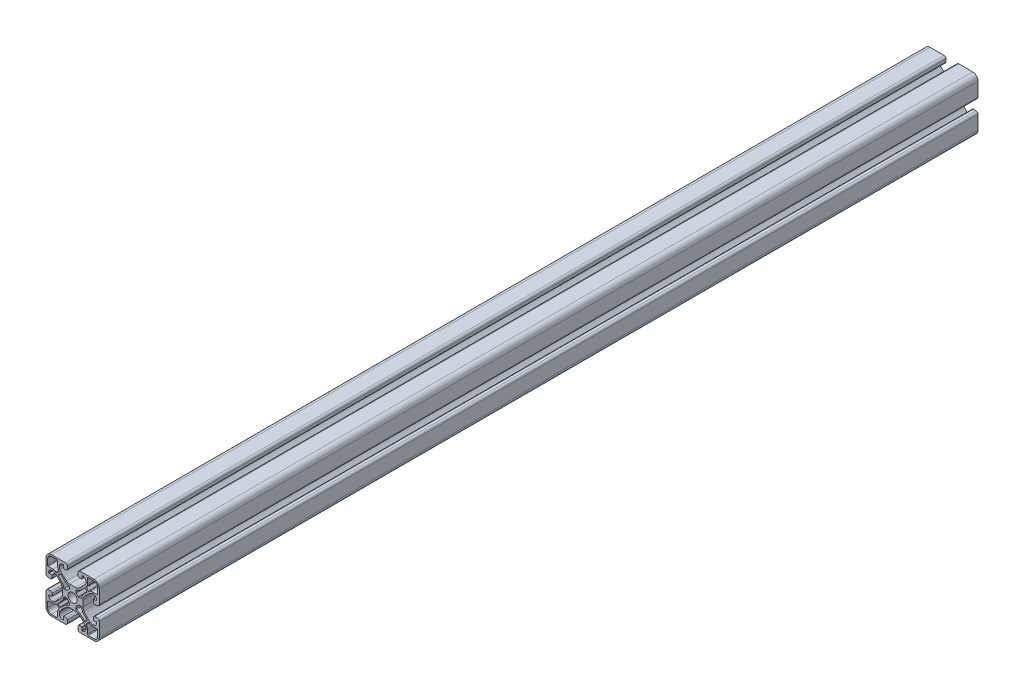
from build123d import *

# Parameters (mm, degrees)
ESQUISSE_PROFIL_R = 3.400000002
EXTRUSION1_DEPTH  = 660


with BuildPart() as part:
    # Esquisse profil → Extrusion1 (new body)
    with BuildSketch(Plane.XY):
        with BuildLine():
            Line((5.500000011, -20), (15.999999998, -20))
            ThreePointArc((15.999999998, -20), (18.82842711, -18.82842713), (20, -16.000000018))
            Line((20, -16.000000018), (20, -5.500000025))
            ThreePointArc((20, -5.500000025), (19.560660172, -4.439339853), (18.5, -4.000000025))
            Line((18.5, -4.000000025), (16.5, -4.000000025))
            ThreePointArc((16.5, -4.000000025), (15.792893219, -4.292893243), (15.5, -5.000000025))
            Line((15.5, -5.000000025), (15.5, -6.750000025))
            ThreePointArc((15.5, -6.750000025), (15.573223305, -6.92677672), (15.75, -7.000000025))
            Line((15.75, -7.000000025), (17.75, -7.000000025))
            ThreePointArc((17.75, -7.000000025), (17.926776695, -7.073223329), (18, -7.250000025))
            Line((18, -7.250000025), (18, -7.500000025))
            ThreePointArc((18, -7.500000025), (17.267766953, -9.267766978), (15.5, -10.000000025))
            Line((15.5, -10.000000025), (14.72036024, -10.000000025))
            ThreePointArc((14.72036024, -10.000000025), (14.083793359, -9.895991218), (13.51343504, -9.594782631))
            ThreePointArc((13.51343504, -9.594782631), (10.848996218, -7.2640298), (8.540476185, -4.580305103))
            ThreePointArc((8.540476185, -4.580305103), (7.952757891, -3.450415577), (7.75, -2.193056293))
            Line((7.75, -2.193056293), (7.75, 2.193056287))
            ThreePointArc((7.75, 2.193056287), (7.952757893, 3.450415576), (8.54047619, 4.580305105))
            ThreePointArc((8.54047619, 4.580305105), (10.848996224, 7.264029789), (13.513435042, 9.594782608))
            ThreePointArc((13.513435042, 9.594782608), (14.083793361, 9.895991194), (14.72036024, 10))
            Line((14.72036024, 10), (15.5, 10))
            ThreePointArc((15.5, 10), (17.267766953, 9.267766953), (18, 7.5))
            Line((18, 7.5), (18, 7.25))
            ThreePointArc((18, 7.25), (17.926776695, 7.073223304), (17.75, 7))
            Line((17.75, 7), (15.75, 7))
            ThreePointArc((15.75, 7), (15.573223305, 6.926776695), (15.5, 6.75))
            Line((15.5, 6.75), (15.5, 5))
            ThreePointArc((15.5, 5), (15.792893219, 4.292893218), (16.5, 4))
            Line((16.5, 4), (18.5, 4))
            ThreePointArc((18.5, 4), (19.560660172, 4.439339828), (20, 5.5))
            Line((20, 5.5), (20, 16.000000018))
            ThreePointArc((20, 16.000000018), (18.828427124, 18.828427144), (15.999999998, 20))
            Line((15.999999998, 20), (5.500000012, 20))
            ThreePointArc((5.500000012, 20), (4.43933984, 19.560660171), (4.000000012, 18.5))
            Line((4.000000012, 18.5), (4.000000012, 16.5))
            ThreePointArc((4.000000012, 16.5), (4.292893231, 15.792893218), (5.000000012, 15.5))
            Line((5.000000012, 15.5), (6.750000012, 15.5))
            ThreePointArc((6.750000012, 15.5), (6.926776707, 15.573223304), (7.000000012, 15.75))
            Line((7.000000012, 15.75), (7.000000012, 17.75))
            ThreePointArc((7.000000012, 17.75), (7.073223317, 17.926776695), (7.250000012, 18))
            Line((7.250000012, 18), (7.500000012, 18))
            ThreePointArc((7.500000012, 18), (9.267766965, 17.267766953), (10.000000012, 15.5))
            Line((10.000000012, 15.5), (10.000000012, 14.72036024))
            ThreePointArc((10.000000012, 14.72036024), (9.895991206, 14.083793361), (9.594782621, 13.513435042))
            ThreePointArc((9.594782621, 13.513435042), (7.264029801, 10.848996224), (4.580305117, 8.540476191))
            ThreePointArc((4.580305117, 8.540476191), (3.450415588, 7.952757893), (2.193056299, 7.75))
            Line((2.193056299, 7.75), (-2.193056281, 7.75))
            ThreePointArc((-2.193056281, 7.75), (-3.45041557, 7.952757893), (-4.580305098, 8.54047619))
            ThreePointArc((-4.580305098, 8.54047619), (-7.264029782, 10.848996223), (-9.594782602, 13.513435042))
            ThreePointArc((-9.594782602, 13.513435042), (-9.895991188, 14.08379336), (-9.999999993, 14.72036024))
            Line((-9.999999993, 14.72036024), (-9.999999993, 15.5))
            ThreePointArc((-9.999999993, 15.5), (-9.267766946, 17.267766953), (-7.499999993, 18))
            Line((-7.499999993, 18), (-7.249999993, 18))
            ThreePointArc((-7.249999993, 18), (-7.073223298, 17.926776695), (-6.999999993, 17.75))
            Line((-6.999999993, 17.75), (-6.999999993, 15.75))
            ThreePointArc((-6.999999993, 15.75), (-6.926776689, 15.573223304), (-6.749999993, 15.5))
            Line((-6.749999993, 15.5), (-4.999999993, 15.5))
            ThreePointArc((-4.999999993, 15.5), (-4.292893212, 15.792893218), (-3.999999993, 16.5))
            Line((-3.999999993, 16.5), (-3.999999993, 18.5))
            ThreePointArc((-3.999999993, 18.5), (-4.439339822, 19.560660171), (-5.499999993, 20))
            Line((-5.499999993, 20), (-15.999999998, 20))
            ThreePointArc((-15.999999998, 20), (-18.82842711, 18.82842713), (-20, 16.000000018))
            Line((-20, 16.000000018), (-20, 5.499999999))
            ThreePointArc((-20, 5.499999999), (-19.560660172, 4.439339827), (-18.5, 3.999999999))
            Line((-18.5, 3.999999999), (-16.5, 3.999999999))
            ThreePointArc((-16.5, 3.999999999), (-15.792893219, 4.292893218), (-15.5, 4.999999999))
            Line((-15.5, 4.999999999), (-15.5, 6.749999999))
            ThreePointArc((-15.5, 6.749999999), (-15.573223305, 6.926776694), (-15.75, 6.999999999))
            Line((-15.75, 6.999999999), (-17.75, 6.999999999))
            ThreePointArc((-17.75, 6.999999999), (-17.926776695, 7.073223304), (-18, 7.249999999))
            Line((-18, 7.249999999), (-18, 7.499999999))
            ThreePointArc((-18, 7.499999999), (-17.267766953, 9.267766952), (-15.5, 9.999999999))
            Line((-15.5, 9.999999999), (-14.72036024, 9.999999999))
            ThreePointArc((-14.72036024, 9.999999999), (-14.083793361, 9.895991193), (-13.513435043, 9.594782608))
            ThreePointArc((-13.513435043, 9.594782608), (-10.848996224, 7.264029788), (-8.540476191, 4.580305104))
            ThreePointArc((-8.540476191, 4.580305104), (-7.952757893, 3.450415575), (-7.75, 2.193056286))
            Line((-7.75, 2.193056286), (-7.75, -2.193056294))
            ThreePointArc((-7.75, -2.193056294), (-7.952757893, -3.450415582), (-8.54047619, -4.580305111))
            ThreePointArc((-8.54047619, -4.580305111), (-10.848996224, -7.264029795), (-13.513435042, -9.594782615))
            ThreePointArc((-13.513435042, -9.594782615), (-14.083793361, -9.8959912), (-14.72036024, -10.000000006))
            Line((-14.72036024, -10.000000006), (-15.5, -10.000000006))
            ThreePointArc((-15.5, -10.000000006), (-17.267766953, -9.267766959), (-18, -7.500000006))
            Line((-18, -7.500000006), (-18, -7.250000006))
            ThreePointArc((-18, -7.250000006), (-17.926776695, -7.073223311), (-17.75, -7.000000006))
            Line((-17.75, -7.000000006), (-15.75, -7.000000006))
            ThreePointArc((-15.75, -7.000000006), (-15.573223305, -6.926776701), (-15.5, -6.750000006))
            Line((-15.5, -6.750000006), (-15.5, -5.000000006))
            ThreePointArc((-15.5, -5.000000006), (-15.792893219, -4.292893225), (-16.5, -4.000000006))
            Line((-16.5, -4.000000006), (-18.5, -4.000000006))
            ThreePointArc((-18.5, -4.000000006), (-19.560660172, -4.439339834), (-20, -5.500000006))
            Line((-20, -5.500000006), (-20, -15.999999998))
            ThreePointArc((-20, -15.999999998), (-18.828427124, -18.828427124), (-15.999999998, -20))
            Line((-15.999999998, -20), (-5.499999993, -20))
            ThreePointArc((-5.499999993, -20), (-4.439339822, -19.560660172), (-3.999999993, -18.5))
            Line((-3.999999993, -18.5), (-3.999999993, -16.5))
            ThreePointArc((-3.999999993, -16.5), (-4.292893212, -15.792893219), (-4.999999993, -15.5))
            Line((-4.999999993, -15.5), (-6.749999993, -15.5))
            ThreePointArc((-6.749999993, -15.5), (-6.926776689, -15.573223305), (-6.999999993, -15.75))
            Line((-6.999999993, -15.75), (-6.999999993, -17.75))
            ThreePointArc((-6.999999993, -17.75), (-7.073223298, -17.926776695), (-7.249999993, -18))
            Line((-7.249999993, -18), (-7.499999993, -18))
            ThreePointArc((-7.499999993, -18), (-9.267766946, -17.267766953), (-9.999999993, -15.5))
            Line((-9.999999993, -15.5), (-9.999999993, -14.72036024))
            ThreePointArc((-9.999999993, -14.72036024), (-9.895991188, -14.083793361), (-9.594782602, -13.513435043))
            ThreePointArc((-9.594782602, -13.513435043), (-7.264029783, -10.848996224), (-4.580305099, -8.540476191))
            ThreePointArc((-4.580305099, -8.540476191), (-3.45041557, -7.952757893), (-2.193056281, -7.75))
            Line((-2.193056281, -7.75), (2.193056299, -7.75))
            ThreePointArc((2.193056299, -7.75), (3.450415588, -7.952757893), (4.580305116, -8.54047619))
            ThreePointArc((4.580305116, -8.54047619), (7.264029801, -10.848996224), (9.59478262, -13.513435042))
            ThreePointArc((9.59478262, -13.513435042), (9.895991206, -14.083793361), (10.000000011, -14.72036024))
            Line((10.000000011, -14.72036024), (10.000000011, -15.5))
            ThreePointArc((10.000000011, -15.5), (9.267766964, -17.267766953), (7.500000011, -18))
            Line((7.500000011, -18), (7.250000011, -18))
            ThreePointArc((7.250000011, -18), (7.073223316, -17.926776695), (7.000000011, -17.75))
            Line((7.000000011, -17.75), (7.000000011, -15.75))
            ThreePointArc((7.000000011, -15.75), (6.926776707, -15.573223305), (6.750000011, -15.5))
            Line((6.750000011, -15.5), (5.000000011, -15.5))
            ThreePointArc((5.000000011, -15.5), (4.29289323, -15.792893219), (4.000000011, -16.5))
            Line((4.000000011, -16.5), (4.000000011, -18.5))
            ThreePointArc((4.000000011, -18.5), (4.43933984, -19.560660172), (5.500000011, -20))
        make_face()
        Circle(ESQUISSE_PROFIL_R, mode=Mode.SUBTRACT)
        with BuildLine():
            Line((11.699666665, 18.8), (15.999999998, 18.8))
            ThreePointArc((15.999999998, 18.8), (17.979898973, 17.979898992), (18.8, 16.000000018))
            Line((18.8, 16.000000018), (18.8, 11.699999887))
            ThreePointArc((18.8, 11.699999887), (18.653553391, 11.346446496), (18.3, 11.199999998))
            Line((18.3, 11.199999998), (14.670026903, 11.199999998))
            ThreePointArc((14.670026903, 11.199999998), (13.651519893, 11.033585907), (12.738946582, 10.551652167))
            Line((12.738946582, 10.551652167), (12.395722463, 10.287411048))
            ThreePointArc((12.395722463, 10.287411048), (12.057202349, 10.181979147), (11.733887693, 10.327510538))
            Line((11.733887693, 10.327510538), (10.327177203, 11.734221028))
            ThreePointArc((10.327177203, 11.734221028), (10.181645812, 12.057535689), (10.287077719, 12.396055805))
            Line((10.287077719, 12.396055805), (10.551318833, 12.739279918))
            ThreePointArc((10.551318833, 12.739279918), (11.033252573, 13.651853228), (11.199666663, 14.670360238))
            Line((11.199666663, 14.670360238), (11.199666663, 18.299999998))
            ThreePointArc((11.199666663, 18.299999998), (11.346113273, 18.65355339), (11.699666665, 18.8))
        make_face(mode=Mode.SUBTRACT)
        with BuildLine():
            Line((-11.199666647, 14.669919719), (-11.199666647, 18.299999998))
            ThreePointArc((-11.199666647, 18.299999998), (-11.346113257, 18.65355339), (-11.699666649, 18.8))
            Line((-11.699666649, 18.8), (-15.999999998, 18.8))
            ThreePointArc((-15.999999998, 18.8), (-17.979898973, 17.979898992), (-18.8, 16.000000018))
            Line((-18.8, 16.000000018), (-18.8, 11.699999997))
            ThreePointArc((-18.8, 11.699999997), (-18.653553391, 11.346446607), (-18.3, 11.199999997))
            Line((-18.3, 11.199999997), (-14.67036024, 11.199999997))
            ThreePointArc((-14.67036024, 11.199999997), (-13.65185323, 11.033585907), (-12.739279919, 10.551652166))
            Line((-12.739279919, 10.551652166), (-12.3960558, 10.287411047))
            ThreePointArc((-12.3960558, 10.287411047), (-12.057535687, 10.181979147), (-11.73422103, 10.327510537))
            Line((-11.73422103, 10.327510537), (-10.32751054, 11.734221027))
            ThreePointArc((-10.32751054, 11.734221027), (-10.181979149, 12.057535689), (-10.287411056, 12.396055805))
            Line((-10.287411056, 12.396055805), (-10.551651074, 12.739278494))
            ThreePointArc((-10.551651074, 12.739278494), (-11.033340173, 13.651673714), (-11.199666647, 14.669919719))
        make_face(mode=Mode.SUBTRACT)
        with BuildLine():
            Line((-2.500000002, 6.098239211), (-2.500000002, 4.609772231))
            ThreePointArc((-2.500000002, 4.609772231), (-2.560475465, 4.371406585), (-2.727272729, 4.19070203))
            ThreePointArc((-2.727272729, 4.19070203), (-3.535533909, 3.535533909), (-4.19070203, 2.727272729))
            ThreePointArc((-4.19070203, 2.727272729), (-4.371406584, 2.560475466), (-4.609772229, 2.500000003))
            Line((-4.609772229, 2.500000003), (-6.098239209, 2.500000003))
            ThreePointArc((-6.098239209, 2.500000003), (-6.428045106, 2.62419677), (-6.594007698, 2.935087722))
            ThreePointArc((-6.594007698, 2.935087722), (-6.934262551, 4.221803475), (-7.589999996, 5.380000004))
            ThreePointArc((-7.589999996, 5.380000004), (-9.089852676, 7.202595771), (-10.747651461, 8.882809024))
            ThreePointArc((-10.747651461, 8.882809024), (-10.907820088, 9.24007063), (-10.761465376, 9.603209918))
            Line((-10.761465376, 9.603209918), (-9.603209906, 10.761465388))
            ThreePointArc((-9.603209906, 10.761465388), (-9.240070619, 10.907820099), (-8.882809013, 10.747651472))
            ThreePointArc((-8.882809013, 10.747651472), (-7.202595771, 9.089852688), (-5.380000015, 7.590000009))
            ThreePointArc((-5.380000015, 7.590000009), (-4.221803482, 6.934262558), (-2.935087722, 6.594007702))
            ThreePointArc((-2.935087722, 6.594007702), (-2.624196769, 6.428045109), (-2.500000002, 6.098239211))
        make_face(mode=Mode.SUBTRACT)
        with BuildLine():
            Line((-10.761465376, -9.603209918), (-9.603209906, -10.761465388))
            ThreePointArc((-9.603209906, -10.761465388), (-9.240070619, -10.907820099), (-8.882809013, -10.747651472))
            ThreePointArc((-8.882809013, -10.747651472), (-7.202595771, -9.089852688), (-5.380000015, -7.590000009))
            ThreePointArc((-5.380000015, -7.590000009), (-4.221803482, -6.934262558), (-2.935087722, -6.594007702))
            ThreePointArc((-2.935087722, -6.594007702), (-2.624196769, -6.428045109), (-2.500000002, -6.098239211))
            Line((-2.500000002, -6.098239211), (-2.500000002, -4.609772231))
            ThreePointArc((-2.500000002, -4.609772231), (-2.560475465, -4.371406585), (-2.727272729, -4.19070203))
            ThreePointArc((-2.727272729, -4.19070203), (-3.535533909, -3.535533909), (-4.19070203, -2.727272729))
            ThreePointArc((-4.19070203, -2.727272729), (-4.371406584, -2.560475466), (-4.609772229, -2.500000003))
            Line((-4.609772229, -2.500000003), (-6.098239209, -2.500000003))
            ThreePointArc((-6.098239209, -2.500000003), (-6.428045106, -2.62419677), (-6.594007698, -2.935087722))
            ThreePointArc((-6.594007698, -2.935087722), (-6.934262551, -4.221803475), (-7.589999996, -5.380000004))
            ThreePointArc((-7.589999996, -5.380000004), (-9.089852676, -7.202595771), (-10.747651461, -8.882809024))
            ThreePointArc((-10.747651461, -8.882809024), (-10.907820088, -9.24007063), (-10.761465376, -9.603209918))
        make_face(mode=Mode.SUBTRACT)
        with BuildLine():
            Line((-11.699999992, -18.8), (-15.999999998, -18.8))
            ThreePointArc((-15.999999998, -18.8), (-17.979898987, -17.979898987), (-18.8, -15.999999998))
            Line((-18.8, -15.999999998), (-18.8, -11.700000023))
            ThreePointArc((-18.8, -11.700000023), (-18.653553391, -11.346446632), (-18.3, -11.200000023))
            Line((-18.3, -11.200000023), (-14.67036024, -11.200000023))
            ThreePointArc((-14.67036024, -11.200000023), (-13.65185323, -11.033585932), (-12.739279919, -10.551652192))
            Line((-12.739279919, -10.551652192), (-12.3960558, -10.287411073))
            ThreePointArc((-12.3960558, -10.287411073), (-12.057535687, -10.181979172), (-11.73422103, -10.327510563))
            Line((-11.73422103, -10.327510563), (-10.32751054, -11.734221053))
            ThreePointArc((-10.32751054, -11.734221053), (-10.181979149, -12.057535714), (-10.287411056, -12.39605583))
            Line((-10.287411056, -12.39605583), (-10.55165217, -12.739279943))
            ThreePointArc((-10.55165217, -12.739279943), (-11.033585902, -13.651853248), (-11.19999999, -14.670360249))
            Line((-11.19999999, -14.670360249), (-11.19999999, -18.299999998))
            ThreePointArc((-11.19999999, -18.299999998), (-11.3464466, -18.65355339), (-11.699999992, -18.8))
        make_face(mode=Mode.SUBTRACT)
        with BuildLine():
            Line((9.603209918, 10.761465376), (10.761465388, 9.603209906))
            ThreePointArc((10.761465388, 9.603209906), (10.907820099, 9.240070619), (10.747651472, 8.882809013))
            ThreePointArc((10.747651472, 8.882809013), (9.089852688, 7.202595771), (7.590000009, 5.380000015))
            ThreePointArc((7.590000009, 5.380000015), (6.934262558, 4.221803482), (6.594007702, 2.935087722))
            ThreePointArc((6.594007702, 2.935087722), (6.428045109, 2.624196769), (6.098239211, 2.500000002))
            Line((6.098239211, 2.500000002), (4.609772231, 2.500000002))
            ThreePointArc((4.609772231, 2.500000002), (4.371406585, 2.560475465), (4.19070203, 2.727272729))
            ThreePointArc((4.19070203, 2.727272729), (3.535533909, 3.535533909), (2.727272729, 4.19070203))
            ThreePointArc((2.727272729, 4.19070203), (2.560475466, 4.371406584), (2.500000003, 4.609772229))
            Line((2.500000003, 4.609772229), (2.500000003, 6.098239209))
            ThreePointArc((2.500000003, 6.098239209), (2.62419677, 6.428045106), (2.935087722, 6.594007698))
            ThreePointArc((2.935087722, 6.594007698), (4.221803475, 6.934262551), (5.380000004, 7.589999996))
            ThreePointArc((5.380000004, 7.589999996), (7.202595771, 9.089852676), (8.882809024, 10.747651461))
            ThreePointArc((8.882809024, 10.747651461), (9.24007063, 10.907820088), (9.603209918, 10.761465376))
        make_face(mode=Mode.SUBTRACT)
        with BuildLine():
            Line((2.500000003, -4.609772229), (2.500000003, -6.098239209))
            ThreePointArc((2.500000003, -6.098239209), (2.62419677, -6.428045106), (2.935087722, -6.594007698))
            ThreePointArc((2.935087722, -6.594007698), (4.221803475, -6.934262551), (5.380000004, -7.589999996))
            ThreePointArc((5.380000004, -7.589999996), (7.202595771, -9.089852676), (8.882809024, -10.747651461))
            ThreePointArc((8.882809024, -10.747651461), (9.24007063, -10.907820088), (9.603209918, -10.761465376))
            Line((9.603209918, -10.761465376), (10.761465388, -9.603209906))
            ThreePointArc((10.761465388, -9.603209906), (10.907820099, -9.240070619), (10.747651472, -8.882809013))
            ThreePointArc((10.747651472, -8.882809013), (9.089852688, -7.202595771), (7.590000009, -5.380000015))
            ThreePointArc((7.590000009, -5.380000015), (6.934262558, -4.221803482), (6.594007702, -2.935087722))
            ThreePointArc((6.594007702, -2.935087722), (6.428045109, -2.624196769), (6.098239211, -2.500000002))
            Line((6.098239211, -2.500000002), (4.609772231, -2.500000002))
            ThreePointArc((4.609772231, -2.500000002), (4.371406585, -2.560475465), (4.19070203, -2.727272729))
            ThreePointArc((4.19070203, -2.727272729), (3.535533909, -3.535533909), (2.727272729, -4.19070203))
            ThreePointArc((2.727272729, -4.19070203), (2.560475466, -4.371406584), (2.500000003, -4.609772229))
        make_face(mode=Mode.SUBTRACT)
        with BuildLine():
            Line((11.199666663, -14.670360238), (11.199666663, -18.299999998))
            ThreePointArc((11.199666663, -18.299999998), (11.346113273, -18.65355339), (11.699666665, -18.8))
            Line((11.699666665, -18.8), (15.999999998, -18.8))
            ThreePointArc((15.999999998, -18.8), (17.979898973, -17.979898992), (18.8, -16.000000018))
            Line((18.8, -16.000000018), (18.8, -11.699999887))
            ThreePointArc((18.8, -11.699999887), (18.653553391, -11.346446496), (18.3, -11.199999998))
            Line((18.3, -11.199999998), (14.670026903, -11.199999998))
            ThreePointArc((14.670026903, -11.199999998), (13.651519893, -11.033585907), (12.738946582, -10.551652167))
            Line((12.738946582, -10.551652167), (12.395722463, -10.287411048))
            ThreePointArc((12.395722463, -10.287411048), (12.057202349, -10.181979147), (11.733887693, -10.327510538))
            Line((11.733887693, -10.327510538), (10.327177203, -11.734221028))
            ThreePointArc((10.327177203, -11.734221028), (10.181645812, -12.057535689), (10.287077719, -12.396055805))
            Line((10.287077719, -12.396055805), (10.551318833, -12.739279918))
            ThreePointArc((10.551318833, -12.739279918), (11.033252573, -13.651853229), (11.199666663, -14.670360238))
        make_face(mode=Mode.SUBTRACT)
    extrude(amount=EXTRUSION1_DEPTH)


solid = part.part
